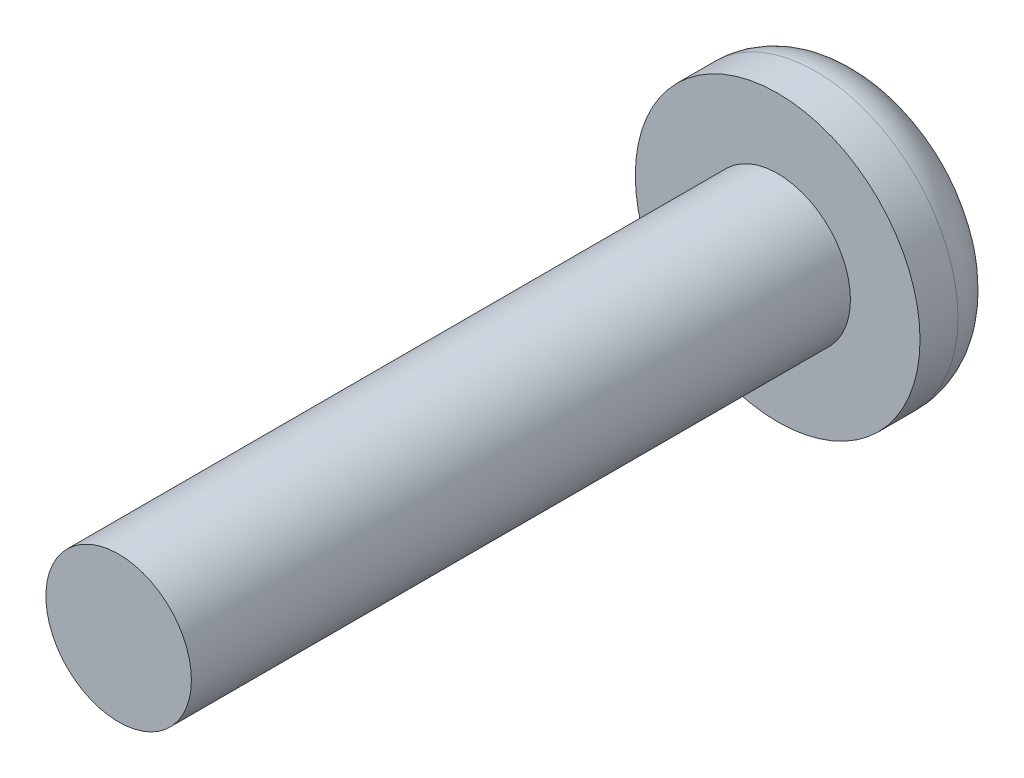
ISO-10303-21;
HEADER;
FILE_DESCRIPTION(('STEP AP214'),'2;1');
FILE_NAME('part.step','',(''),(''),'','','');
FILE_SCHEMA(('AUTOMOTIVE_DESIGN { 1 0 10303 214 1 1 1 1 }'));
ENDSEC;
DATA;
#1=APPLICATION_CONTEXT('core data for automotive mechanical design processes');
#2=APPLICATION_PROTOCOL_DEFINITION('international standard','automotive_design',2000,#1);
#3=PRODUCT_CONTEXT('',#1,'mechanical');
#4=PRODUCT('Part','Part','',(#3));
#5=PRODUCT_RELATED_PRODUCT_CATEGORY('part','',(#4));
#6=PRODUCT_DEFINITION_FORMATION('','',#4);
#7=PRODUCT_DEFINITION_CONTEXT('part definition',#1,'design');
#8=PRODUCT_DEFINITION('design','',#6,#7);
#9=PRODUCT_DEFINITION_SHAPE('','',#8);
#10=(LENGTH_UNIT() NAMED_UNIT(*) SI_UNIT(.MILLI.,.METRE.));
#11=(NAMED_UNIT(*) PLANE_ANGLE_UNIT() SI_UNIT($,.RADIAN.));
#12=(NAMED_UNIT(*) SI_UNIT($,.STERADIAN.) SOLID_ANGLE_UNIT());
#13=UNCERTAINTY_MEASURE_WITH_UNIT(LENGTH_MEASURE(1.E-05),#10,'distance_accuracy_value','');
#14=(GEOMETRIC_REPRESENTATION_CONTEXT(3) GLOBAL_UNCERTAINTY_ASSIGNED_CONTEXT((#13)) GLOBAL_UNIT_ASSIGNED_CONTEXT((#10,
#11,#12)) REPRESENTATION_CONTEXT('',''));
#15=CARTESIAN_POINT('',(0.,0.,0.));
#16=DIRECTION('',(0.,0.,1.));
#17=DIRECTION('',(1.,0.,0.));
#18=AXIS2_PLACEMENT_3D('',#15,#16,#17);
#19=CARTESIAN_POINT('',(0.,0.,-2.0828));
#20=DIRECTION('',(0.,0.,-1.));
#21=DIRECTION('',(-1.,0.,0.));
#22=AXIS2_PLACEMENT_3D('',#19,#20,#21);
#23=PLANE('',#22);
#24=CARTESIAN_POINT('',(0.,0.,-2.0828));
#25=DIRECTION('',(0.,0.,-1.));
#26=DIRECTION('',(-1.,0.,0.));
#27=AXIS2_PLACEMENT_3D('',#24,#25,#26);
#28=CIRCLE('',#27,2.2606);
#29=CARTESIAN_POINT('',(-2.2606,0.,-2.0828));
#30=VERTEX_POINT('',#29);
#31=EDGE_CURVE('E38',#30,#30,#28,.T.);
#32=ORIENTED_EDGE('',*,*,#31,.T.);
#33=EDGE_LOOP('',(#32));
#34=FACE_BOUND('',#33,.T.);
#35=DIRECTION('',(0.,-1.,0.));
#36=VECTOR('',#35,1.);
#37=CARTESIAN_POINT('',(1.7526,0.431799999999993,-2.08279999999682));
#38=LINE('',#37,#36);
#39=CARTESIAN_POINT('',(1.7526,0.431799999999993,-2.08279999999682));
#40=VERTEX_POINT('',#39);
#41=CARTESIAN_POINT('',(1.7526,-0.431800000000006,-2.08279999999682));
#42=VERTEX_POINT('',#41);
#43=EDGE_CURVE('E148',#40,#42,#38,.T.);
#44=ORIENTED_EDGE('',*,*,#43,.F.);
#45=DIRECTION('',(-1.,0.,0.));
#46=VECTOR('',#45,1.);
#47=CARTESIAN_POINT('',(1.7526,0.431799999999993,-2.08279999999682));
#48=LINE('',#47,#46);
#49=CARTESIAN_POINT('',(0.4318,0.431799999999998,-2.08279999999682));
#50=VERTEX_POINT('',#49);
#51=EDGE_CURVE('E147',#40,#50,#48,.T.);
#52=ORIENTED_EDGE('',*,*,#51,.T.);
#53=DIRECTION('',(0.,1.,0.));
#54=VECTOR('',#53,1.);
#55=CARTESIAN_POINT('',(0.4318,0.,-2.08279999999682));
#56=LINE('',#55,#54);
#57=CARTESIAN_POINT('',(0.4318,1.7526,-2.08279999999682));
#58=VERTEX_POINT('',#57);
#59=EDGE_CURVE('E171',#50,#58,#56,.T.);
#60=ORIENTED_EDGE('',*,*,#59,.T.);
#61=DIRECTION('',(1.,0.,0.));
#62=VECTOR('',#61,1.);
#63=CARTESIAN_POINT('',(-0.431799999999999,1.7526,-2.08279999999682));
#64=LINE('',#63,#62);
#65=CARTESIAN_POINT('',(-0.431799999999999,1.7526,-2.08279999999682));
#66=VERTEX_POINT('',#65);
#67=EDGE_CURVE('E173',#66,#58,#64,.T.);
#68=ORIENTED_EDGE('',*,*,#67,.F.);
#69=DIRECTION('',(0.,-1.,0.));
#70=VECTOR('',#69,1.);
#71=CARTESIAN_POINT('',(-0.431799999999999,1.7526,-2.08279999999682));
#72=LINE('',#71,#70);
#73=CARTESIAN_POINT('',(-0.431799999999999,0.431800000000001,-2.08279999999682));
#74=VERTEX_POINT('',#73);
#75=EDGE_CURVE('E146',#66,#74,#72,.T.);
#76=ORIENTED_EDGE('',*,*,#75,.T.);
#77=CARTESIAN_POINT('',(-1.7526,0.431800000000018,-2.08279999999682));
#78=VERTEX_POINT('',#77);
#79=EDGE_CURVE('E125',#74,#78,#48,.T.);
#80=ORIENTED_EDGE('',*,*,#79,.T.);
#81=DIRECTION('',(0.,1.,0.));
#82=VECTOR('',#81,1.);
#83=CARTESIAN_POINT('',(-1.75260000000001,-0.431799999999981,-2.08279999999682));
#84=LINE('',#83,#82);
#85=CARTESIAN_POINT('',(-1.75260000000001,-0.431799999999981,-2.08279999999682));
#86=VERTEX_POINT('',#85);
#87=EDGE_CURVE('E136',#86,#78,#84,.T.);
#88=ORIENTED_EDGE('',*,*,#87,.F.);
#89=DIRECTION('',(1.,0.,0.));
#90=VECTOR('',#89,1.);
#91=CARTESIAN_POINT('',(-1.75260000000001,-0.431799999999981,-2.08279999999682));
#92=LINE('',#91,#90);
#93=CARTESIAN_POINT('',(-0.431800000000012,-0.431799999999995,-2.08279999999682));
#94=VERTEX_POINT('',#93);
#95=EDGE_CURVE('E141',#86,#94,#92,.T.);
#96=ORIENTED_EDGE('',*,*,#95,.T.);
#97=DIRECTION('',(0.,-1.,0.));
#98=VECTOR('',#97,1.);
#99=CARTESIAN_POINT('',(-0.4318,0.,-2.08279999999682));
#100=LINE('',#99,#98);
#101=CARTESIAN_POINT('',(-0.431800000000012,-1.7526,-2.08279999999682));
#102=VERTEX_POINT('',#101);
#103=EDGE_CURVE('E289',#94,#102,#100,.T.);
#104=ORIENTED_EDGE('',*,*,#103,.T.);
#105=DIRECTION('',(-1.,0.,0.));
#106=VECTOR('',#105,1.);
#107=CARTESIAN_POINT('',(0.431799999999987,-1.75260000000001,-2.08279999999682));
#108=LINE('',#107,#106);
#109=CARTESIAN_POINT('',(0.431799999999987,-1.75260000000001,-2.08279999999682));
#110=VERTEX_POINT('',#109);
#111=EDGE_CURVE('E291',#110,#102,#108,.T.);
#112=ORIENTED_EDGE('',*,*,#111,.F.);
#113=DIRECTION('',(0.,1.,0.));
#114=VECTOR('',#113,1.);
#115=CARTESIAN_POINT('',(0.431799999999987,-1.75260000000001,-2.08279999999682));
#116=LINE('',#115,#114);
#117=CARTESIAN_POINT('',(0.431799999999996,-0.431800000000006,-2.08279999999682));
#118=VERTEX_POINT('',#117);
#119=EDGE_CURVE('E294',#110,#118,#116,.T.);
#120=ORIENTED_EDGE('',*,*,#119,.T.);
#121=DIRECTION('',(1.,0.,0.));
#122=VECTOR('',#121,1.);
#123=CARTESIAN_POINT('',(0.,-0.4318,-2.08279999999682));
#124=LINE('',#123,#122);
#125=EDGE_CURVE('E153',#118,#42,#124,.T.);
#126=ORIENTED_EDGE('',*,*,#125,.T.);
#127=EDGE_LOOP('',(#44,#52,#60,#68,#76,#80,#88,#96,#104,#112,#120,#126));
#128=FACE_BOUND('',#127,.T.);
#129=ADVANCED_FACE('F30',(#34,#128),#23,.T.);
#130=CARTESIAN_POINT('',(0.4318,0.,-1.04139999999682));
#131=DIRECTION('',(-1.,0.,0.));
#132=DIRECTION('',(0.,-1.,0.));
#133=AXIS2_PLACEMENT_3D('',#130,#131,#132);
#134=PLANE('',#133);
#135=ORIENTED_EDGE('',*,*,#59,.F.);
#136=DIRECTION('',(0.,0.,1.));
#137=VECTOR('',#136,1.);
#138=CARTESIAN_POINT('',(0.4318,0.431799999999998,-1.04139999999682));
#139=LINE('',#138,#137);
#140=CARTESIAN_POINT('',(0.4318,0.431799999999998,-1.04139999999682));
#141=VERTEX_POINT('',#140);
#142=EDGE_CURVE('E169',#50,#141,#139,.T.);
#143=ORIENTED_EDGE('',*,*,#142,.T.);
#144=DIRECTION('',(0.,1.,0.));
#145=VECTOR('',#144,1.);
#146=CARTESIAN_POINT('',(0.4318,0.,-1.04139999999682));
#147=LINE('',#146,#145);
#148=CARTESIAN_POINT('',(0.4318,1.7526,-1.04139999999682));
#149=VERTEX_POINT('',#148);
#150=EDGE_CURVE('E53',#141,#149,#147,.T.);
#151=ORIENTED_EDGE('',*,*,#150,.T.);
#152=DIRECTION('',(0.,0.,-1.));
#153=VECTOR('',#152,1.);
#154=CARTESIAN_POINT('',(0.4318,1.7526,-1.04139999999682));
#155=LINE('',#154,#153);
#156=EDGE_CURVE('E184',#149,#58,#155,.T.);
#157=ORIENTED_EDGE('',*,*,#156,.T.);
#158=EDGE_LOOP('',(#135,#143,#151,#157));
#159=FACE_BOUND('',#158,.T.);
#160=ADVANCED_FACE('F218',(#159),#134,.T.);
#161=CARTESIAN_POINT('',(-0.431799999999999,1.7526,-1.04139999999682));
#162=DIRECTION('',(1.,0.,0.));
#163=DIRECTION('',(0.,1.,0.));
#164=AXIS2_PLACEMENT_3D('',#161,#162,#163);
#165=PLANE('',#164);
#166=DIRECTION('',(0.,-1.,0.));
#167=VECTOR('',#166,1.);
#168=CARTESIAN_POINT('',(-0.431799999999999,1.7526,-1.04139999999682));
#169=LINE('',#168,#167);
#170=CARTESIAN_POINT('',(-0.431799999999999,1.7526,-1.04139999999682));
#171=VERTEX_POINT('',#170);
#172=CARTESIAN_POINT('',(-0.431799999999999,0.431800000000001,-1.04139999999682));
#173=VERTEX_POINT('',#172);
#174=EDGE_CURVE('E181',#171,#173,#169,.T.);
#175=ORIENTED_EDGE('',*,*,#174,.T.);
#176=DIRECTION('',(0.,0.,-1.));
#177=VECTOR('',#176,1.);
#178=CARTESIAN_POINT('',(-0.4318,0.431800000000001,-1.04139999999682));
#179=LINE('',#178,#177);
#180=EDGE_CURVE('E167',#173,#74,#179,.T.);
#181=ORIENTED_EDGE('',*,*,#180,.T.);
#182=ORIENTED_EDGE('',*,*,#75,.F.);
#183=DIRECTION('',(0.,0.,-1.));
#184=VECTOR('',#183,1.);
#185=CARTESIAN_POINT('',(-0.431799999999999,1.7526,-1.04139999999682));
#186=LINE('',#185,#184);
#187=EDGE_CURVE('E45',#171,#66,#186,.T.);
#188=ORIENTED_EDGE('',*,*,#187,.F.);
#189=EDGE_LOOP('',(#175,#181,#182,#188));
#190=FACE_BOUND('',#189,.T.);
#191=ADVANCED_FACE('F223',(#190),#165,.T.);
#192=CARTESIAN_POINT('',(0.,0.,15.875));
#193=DIRECTION('',(0.,0.,-1.));
#194=DIRECTION('',(-1.,0.,0.));
#195=AXIS2_PLACEMENT_3D('',#192,#193,#194);
#196=CYLINDRICAL_SURFACE('',#195,1.7526);
#197=CARTESIAN_POINT('',(0.,0.,15.875));
#198=DIRECTION('',(0.,0.,1.));
#199=DIRECTION('',(1.,0.,0.));
#200=AXIS2_PLACEMENT_3D('',#197,#198,#199);
#201=CIRCLE('',#200,1.7526);
#202=CARTESIAN_POINT('',(1.7526,0.,15.875));
#203=VERTEX_POINT('',#202);
#204=EDGE_CURVE('E192',#203,#203,#201,.T.);
#205=ORIENTED_EDGE('',*,*,#204,.F.);
#206=EDGE_LOOP('',(#205));
#207=FACE_BOUND('',#206,.T.);
#208=CARTESIAN_POINT('',(0.,0.,0.));
#209=DIRECTION('',(0.,0.,1.));
#210=DIRECTION('',(1.,0.,0.));
#211=AXIS2_PLACEMENT_3D('',#208,#209,#210);
#212=CIRCLE('',#211,1.7526);
#213=CARTESIAN_POINT('',(1.7526,0.,0.));
#214=VERTEX_POINT('',#213);
#215=EDGE_CURVE('E189',#214,#214,#212,.T.);
#216=ORIENTED_EDGE('',*,*,#215,.T.);
#217=EDGE_LOOP('',(#216));
#218=FACE_BOUND('',#217,.T.);
#219=ADVANCED_FACE('F32',(#207,#218),#196,.T.);
#220=CARTESIAN_POINT('',(0.,0.,15.875));
#221=DIRECTION('',(0.,0.,1.));
#222=DIRECTION('',(1.,0.,0.));
#223=AXIS2_PLACEMENT_3D('',#220,#221,#222);
#224=PLANE('',#223);
#225=ORIENTED_EDGE('',*,*,#204,.T.);
#226=EDGE_LOOP('',(#225));
#227=FACE_BOUND('',#226,.T.);
#228=ADVANCED_FACE('F224',(#227),#224,.T.);
#229=CARTESIAN_POINT('',(3.429,0.,0.));
#230=DIRECTION('',(0.,0.,1.));
#231=DIRECTION('',(1.,0.,0.));
#232=AXIS2_PLACEMENT_3D('',#229,#230,#231);
#233=PLANE('',#232);
#234=CARTESIAN_POINT('',(0.,0.,0.));
#235=DIRECTION('',(0.,0.,-1.));
#236=DIRECTION('',(-1.,0.,0.));
#237=AXIS2_PLACEMENT_3D('',#234,#235,#236);
#238=CIRCLE('',#237,3.429);
#239=CARTESIAN_POINT('',(-3.429,0.,0.));
#240=VERTEX_POINT('',#239);
#241=EDGE_CURVE('E186',#240,#240,#238,.T.);
#242=ORIENTED_EDGE('',*,*,#241,.F.);
#243=EDGE_LOOP('',(#242));
#244=FACE_BOUND('',#243,.T.);
#245=ORIENTED_EDGE('',*,*,#215,.F.);
#246=EDGE_LOOP('',(#245));
#247=FACE_BOUND('',#246,.T.);
#248=ADVANCED_FACE('F211',(#244,#247),#233,.T.);
#249=CARTESIAN_POINT('',(0.,0.,-4.84031750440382));
#250=DIRECTION('',(0.,0.,-1.));
#251=DIRECTION('',(-1.,0.,0.));
#252=AXIS2_PLACEMENT_3D('',#249,#250,#251);
#253=CYLINDRICAL_SURFACE('',#252,3.429);
#254=CARTESIAN_POINT('',(0.,0.,-0.9144));
#255=DIRECTION('',(0.,0.,-1.));
#256=DIRECTION('',(-1.,0.,0.));
#257=AXIS2_PLACEMENT_3D('',#254,#255,#256);
#258=CIRCLE('',#257,3.429);
#259=CARTESIAN_POINT('',(-3.429,0.,-0.9144));
#260=VERTEX_POINT('',#259);
#261=EDGE_CURVE('E11',#260,#260,#258,.F.);
#262=ORIENTED_EDGE('',*,*,#261,.T.);
#263=EDGE_LOOP('',(#262));
#264=FACE_BOUND('',#263,.T.);
#265=ORIENTED_EDGE('',*,*,#241,.T.);
#266=EDGE_LOOP('',(#265));
#267=FACE_BOUND('',#266,.T.);
#268=ADVANCED_FACE('F201',(#264,#267),#253,.T.);
#269=CARTESIAN_POINT('',(0.,0.,-0.9144));
#270=DIRECTION('',(0.,0.,-1.));
#271=DIRECTION('',(-1.,0.,0.));
#272=AXIS2_PLACEMENT_3D('',#269,#270,#271);
#273=TOROIDAL_SURFACE('',#272,2.2606,1.1684);
#274=ORIENTED_EDGE('',*,*,#261,.F.);
#275=EDGE_LOOP('',(#274));
#276=FACE_BOUND('',#275,.T.);
#277=ORIENTED_EDGE('',*,*,#31,.F.);
#278=EDGE_LOOP('',(#277));
#279=FACE_BOUND('',#278,.T.);
#280=ADVANCED_FACE('F198',(#276,#279),#273,.T.);
#281=CARTESIAN_POINT('',(-0.431799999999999,1.7526,-1.04139999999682));
#282=DIRECTION('',(0.,1.,0.));
#283=DIRECTION('',(0.,0.,1.));
#284=AXIS2_PLACEMENT_3D('',#281,#282,#283);
#285=PLANE('',#284);
#286=ORIENTED_EDGE('',*,*,#67,.T.);
#287=ORIENTED_EDGE('',*,*,#156,.F.);
#288=DIRECTION('',(1.,0.,0.));
#289=VECTOR('',#288,1.);
#290=CARTESIAN_POINT('',(-0.431799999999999,1.7526,-1.04139999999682));
#291=LINE('',#290,#289);
#292=EDGE_CURVE('E178',#171,#149,#291,.T.);
#293=ORIENTED_EDGE('',*,*,#292,.F.);
#294=ORIENTED_EDGE('',*,*,#187,.T.);
#295=EDGE_LOOP('',(#286,#287,#293,#294));
#296=FACE_BOUND('',#295,.T.);
#297=ADVANCED_FACE('F200',(#296),#285,.F.);
#298=CARTESIAN_POINT('',(0.4318,0.,-1.04139999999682));
#299=DIRECTION('',(0.,0.,1.));
#300=DIRECTION('',(1.,0.,0.));
#301=AXIS2_PLACEMENT_3D('',#298,#299,#300);
#302=PLANE('',#301);
#303=ORIENTED_EDGE('',*,*,#150,.F.);
#304=DIRECTION('',(-1.,0.,0.));
#305=VECTOR('',#304,1.);
#306=CARTESIAN_POINT('',(1.7526,0.431799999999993,-1.04139999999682));
#307=LINE('',#306,#305);
#308=CARTESIAN_POINT('',(1.7526,0.431799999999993,-1.04139999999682));
#309=VERTEX_POINT('',#308);
#310=EDGE_CURVE('E161',#309,#141,#307,.T.);
#311=ORIENTED_EDGE('',*,*,#310,.F.);
#312=DIRECTION('',(0.,-1.,0.));
#313=VECTOR('',#312,1.);
#314=CARTESIAN_POINT('',(1.7526,0.431799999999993,-1.04139999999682));
#315=LINE('',#314,#313);
#316=CARTESIAN_POINT('',(1.7526,-0.431800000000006,-1.04139999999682));
#317=VERTEX_POINT('',#316);
#318=EDGE_CURVE('E158',#309,#317,#315,.T.);
#319=ORIENTED_EDGE('',*,*,#318,.T.);
#320=DIRECTION('',(1.,0.,0.));
#321=VECTOR('',#320,1.);
#322=CARTESIAN_POINT('',(0.,-0.4318,-1.04139999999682));
#323=LINE('',#322,#321);
#324=CARTESIAN_POINT('',(0.431799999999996,-0.431800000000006,-1.04139999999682));
#325=VERTEX_POINT('',#324);
#326=EDGE_CURVE('E151',#325,#317,#323,.T.);
#327=ORIENTED_EDGE('',*,*,#326,.F.);
#328=DIRECTION('',(0.,1.,0.));
#329=VECTOR('',#328,1.);
#330=CARTESIAN_POINT('',(0.431799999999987,-1.75260000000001,-1.04139999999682));
#331=LINE('',#330,#329);
#332=CARTESIAN_POINT('',(0.431799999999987,-1.75260000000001,-1.04139999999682));
#333=VERTEX_POINT('',#332);
#334=EDGE_CURVE('E302',#333,#325,#331,.T.);
#335=ORIENTED_EDGE('',*,*,#334,.F.);
#336=DIRECTION('',(-1.,0.,0.));
#337=VECTOR('',#336,1.);
#338=CARTESIAN_POINT('',(0.431799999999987,-1.75260000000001,-1.04139999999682));
#339=LINE('',#338,#337);
#340=CARTESIAN_POINT('',(-0.431800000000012,-1.7526,-1.04139999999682));
#341=VERTEX_POINT('',#340);
#342=EDGE_CURVE('E299',#333,#341,#339,.T.);
#343=ORIENTED_EDGE('',*,*,#342,.T.);
#344=DIRECTION('',(0.,-1.,0.));
#345=VECTOR('',#344,1.);
#346=CARTESIAN_POINT('',(-0.4318,0.,-1.04139999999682));
#347=LINE('',#346,#345);
#348=CARTESIAN_POINT('',(-0.431800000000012,-0.431799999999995,-1.04139999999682));
#349=VERTEX_POINT('',#348);
#350=EDGE_CURVE('E297',#349,#341,#347,.T.);
#351=ORIENTED_EDGE('',*,*,#350,.F.);
#352=DIRECTION('',(1.,0.,0.));
#353=VECTOR('',#352,1.);
#354=CARTESIAN_POINT('',(-1.75260000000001,-0.431799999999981,-1.04139999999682));
#355=LINE('',#354,#353);
#356=CARTESIAN_POINT('',(-1.75260000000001,-0.431799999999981,-1.04139999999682));
#357=VERTEX_POINT('',#356);
#358=EDGE_CURVE('E283',#357,#349,#355,.T.);
#359=ORIENTED_EDGE('',*,*,#358,.F.);
#360=DIRECTION('',(0.,1.,0.));
#361=VECTOR('',#360,1.);
#362=CARTESIAN_POINT('',(-1.75260000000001,-0.431799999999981,-1.04139999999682));
#363=LINE('',#362,#361);
#364=CARTESIAN_POINT('',(-1.7526,0.431800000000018,-1.04139999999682));
#365=VERTEX_POINT('',#364);
#366=EDGE_CURVE('E281',#357,#365,#363,.T.);
#367=ORIENTED_EDGE('',*,*,#366,.T.);
#368=EDGE_CURVE('E128',#173,#365,#307,.T.);
#369=ORIENTED_EDGE('',*,*,#368,.F.);
#370=ORIENTED_EDGE('',*,*,#174,.F.);
#371=ORIENTED_EDGE('',*,*,#292,.T.);
#372=EDGE_LOOP('',(#303,#311,#319,#327,#335,#343,#351,#359,#367,#369,#370,#371));
#373=FACE_BOUND('',#372,.T.);
#374=ADVANCED_FACE('F208',(#373),#302,.F.);
#375=CARTESIAN_POINT('',(1.7526,0.431799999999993,-1.04139999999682));
#376=DIRECTION('',(0.,-1.,0.));
#377=DIRECTION('',(1.,0.,0.));
#378=AXIS2_PLACEMENT_3D('',#375,#376,#377);
#379=PLANE('',#378);
#380=ORIENTED_EDGE('',*,*,#51,.F.);
#381=DIRECTION('',(0.,0.,-1.));
#382=VECTOR('',#381,1.);
#383=CARTESIAN_POINT('',(1.7526,0.431799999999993,-1.04139999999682));
#384=LINE('',#383,#382);
#385=EDGE_CURVE('E163',#309,#40,#384,.T.);
#386=ORIENTED_EDGE('',*,*,#385,.F.);
#387=ORIENTED_EDGE('',*,*,#310,.T.);
#388=ORIENTED_EDGE('',*,*,#142,.F.);
#389=EDGE_LOOP('',(#380,#386,#387,#388));
#390=FACE_BOUND('',#389,.T.);
#391=ADVANCED_FACE('F246',(#390),#379,.T.);
#392=CARTESIAN_POINT('',(0.,-0.4318,-1.04139999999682));
#393=DIRECTION('',(0.,1.,0.));
#394=DIRECTION('',(-1.,0.,0.));
#395=AXIS2_PLACEMENT_3D('',#392,#393,#394);
#396=PLANE('',#395);
#397=DIRECTION('',(0.,0.,1.));
#398=VECTOR('',#397,1.);
#399=CARTESIAN_POINT('',(0.431799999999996,-0.431800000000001,-1.04139999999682));
#400=LINE('',#399,#398);
#401=EDGE_CURVE('E309',#118,#325,#400,.T.);
#402=ORIENTED_EDGE('',*,*,#401,.T.);
#403=ORIENTED_EDGE('',*,*,#326,.T.);
#404=DIRECTION('',(0.,0.,-1.));
#405=VECTOR('',#404,1.);
#406=CARTESIAN_POINT('',(1.7526,-0.431800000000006,-1.04139999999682));
#407=LINE('',#406,#405);
#408=EDGE_CURVE('E165',#317,#42,#407,.T.);
#409=ORIENTED_EDGE('',*,*,#408,.T.);
#410=ORIENTED_EDGE('',*,*,#125,.F.);
#411=EDGE_LOOP('',(#402,#403,#409,#410));
#412=FACE_BOUND('',#411,.T.);
#413=ADVANCED_FACE('F248',(#412),#396,.T.);
#414=CARTESIAN_POINT('',(1.7526,0.431799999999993,-1.04139999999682));
#415=DIRECTION('',(1.,0.,0.));
#416=DIRECTION('',(0.,1.,0.));
#417=AXIS2_PLACEMENT_3D('',#414,#415,#416);
#418=PLANE('',#417);
#419=ORIENTED_EDGE('',*,*,#43,.T.);
#420=ORIENTED_EDGE('',*,*,#408,.F.);
#421=ORIENTED_EDGE('',*,*,#318,.F.);
#422=ORIENTED_EDGE('',*,*,#385,.T.);
#423=EDGE_LOOP('',(#419,#420,#421,#422));
#424=FACE_BOUND('',#423,.T.);
#425=ADVANCED_FACE('F251',(#424),#418,.F.);
#426=ORIENTED_EDGE('',*,*,#368,.T.);
#427=DIRECTION('',(0.,0.,-1.));
#428=VECTOR('',#427,1.);
#429=CARTESIAN_POINT('',(-1.7526,0.431800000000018,-1.04139999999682));
#430=LINE('',#429,#428);
#431=EDGE_CURVE('E121',#365,#78,#430,.T.);
#432=ORIENTED_EDGE('',*,*,#431,.T.);
#433=ORIENTED_EDGE('',*,*,#79,.F.);
#434=ORIENTED_EDGE('',*,*,#180,.F.);
#435=EDGE_LOOP('',(#426,#432,#433,#434));
#436=FACE_BOUND('',#435,.T.);
#437=ADVANCED_FACE('F123',(#436),#379,.T.);
#438=CARTESIAN_POINT('',(0.431799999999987,-1.75260000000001,-1.04139999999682));
#439=DIRECTION('',(-1.,0.,0.));
#440=DIRECTION('',(0.,-1.,0.));
#441=AXIS2_PLACEMENT_3D('',#438,#439,#440);
#442=PLANE('',#441);
#443=ORIENTED_EDGE('',*,*,#119,.F.);
#444=DIRECTION('',(0.,0.,-1.));
#445=VECTOR('',#444,1.);
#446=CARTESIAN_POINT('',(0.431799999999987,-1.75260000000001,-1.04139999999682));
#447=LINE('',#446,#445);
#448=EDGE_CURVE('E305',#333,#110,#447,.T.);
#449=ORIENTED_EDGE('',*,*,#448,.F.);
#450=ORIENTED_EDGE('',*,*,#334,.T.);
#451=ORIENTED_EDGE('',*,*,#401,.F.);
#452=EDGE_LOOP('',(#443,#449,#450,#451));
#453=FACE_BOUND('',#452,.T.);
#454=ADVANCED_FACE('F258',(#453),#442,.T.);
#455=CARTESIAN_POINT('',(-0.4318,0.,-1.04139999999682));
#456=DIRECTION('',(1.,0.,0.));
#457=DIRECTION('',(0.,1.,0.));
#458=AXIS2_PLACEMENT_3D('',#455,#456,#457);
#459=PLANE('',#458);
#460=DIRECTION('',(0.,0.,1.));
#461=VECTOR('',#460,1.);
#462=CARTESIAN_POINT('',(-0.431800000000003,-0.431799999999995,-1.04139999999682));
#463=LINE('',#462,#461);
#464=EDGE_CURVE('E132',#94,#349,#463,.T.);
#465=ORIENTED_EDGE('',*,*,#464,.T.);
#466=ORIENTED_EDGE('',*,*,#350,.T.);
#467=DIRECTION('',(0.,0.,-1.));
#468=VECTOR('',#467,1.);
#469=CARTESIAN_POINT('',(-0.431800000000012,-1.7526,-1.04139999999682));
#470=LINE('',#469,#468);
#471=EDGE_CURVE('E307',#341,#102,#470,.T.);
#472=ORIENTED_EDGE('',*,*,#471,.T.);
#473=ORIENTED_EDGE('',*,*,#103,.F.);
#474=EDGE_LOOP('',(#465,#466,#472,#473));
#475=FACE_BOUND('',#474,.T.);
#476=ADVANCED_FACE('F259',(#475),#459,.T.);
#477=CARTESIAN_POINT('',(0.431799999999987,-1.75260000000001,-1.04139999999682));
#478=DIRECTION('',(0.,-1.,0.));
#479=DIRECTION('',(1.,0.,0.));
#480=AXIS2_PLACEMENT_3D('',#477,#478,#479);
#481=PLANE('',#480);
#482=ORIENTED_EDGE('',*,*,#111,.T.);
#483=ORIENTED_EDGE('',*,*,#471,.F.);
#484=ORIENTED_EDGE('',*,*,#342,.F.);
#485=ORIENTED_EDGE('',*,*,#448,.T.);
#486=EDGE_LOOP('',(#482,#483,#484,#485));
#487=FACE_BOUND('',#486,.T.);
#488=ADVANCED_FACE('F262',(#487),#481,.F.);
#489=CARTESIAN_POINT('',(-1.75260000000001,-0.431799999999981,-1.04139999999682));
#490=DIRECTION('',(0.,1.,0.));
#491=DIRECTION('',(-1.,0.,0.));
#492=AXIS2_PLACEMENT_3D('',#489,#490,#491);
#493=PLANE('',#492);
#494=ORIENTED_EDGE('',*,*,#95,.F.);
#495=DIRECTION('',(0.,0.,-1.));
#496=VECTOR('',#495,1.);
#497=CARTESIAN_POINT('',(-1.75260000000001,-0.431799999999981,-1.04139999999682));
#498=LINE('',#497,#496);
#499=EDGE_CURVE('E133',#357,#86,#498,.T.);
#500=ORIENTED_EDGE('',*,*,#499,.F.);
#501=ORIENTED_EDGE('',*,*,#358,.T.);
#502=ORIENTED_EDGE('',*,*,#464,.F.);
#503=EDGE_LOOP('',(#494,#500,#501,#502));
#504=FACE_BOUND('',#503,.T.);
#505=ADVANCED_FACE('F266',(#504),#493,.T.);
#506=CARTESIAN_POINT('',(-1.75260000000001,-0.431799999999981,-1.04139999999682));
#507=DIRECTION('',(-1.,0.,0.));
#508=DIRECTION('',(0.,-1.,0.));
#509=AXIS2_PLACEMENT_3D('',#506,#507,#508);
#510=PLANE('',#509);
#511=ORIENTED_EDGE('',*,*,#87,.T.);
#512=ORIENTED_EDGE('',*,*,#431,.F.);
#513=ORIENTED_EDGE('',*,*,#366,.F.);
#514=ORIENTED_EDGE('',*,*,#499,.T.);
#515=EDGE_LOOP('',(#511,#512,#513,#514));
#516=FACE_BOUND('',#515,.T.);
#517=ADVANCED_FACE('F137',(#516),#510,.F.);
#518=CLOSED_SHELL('',(#129,#160,#191,#219,#228,#248,#268,#280,#297,#374,#391,#413,#425,#437,
#454,#476,#488,#505,#517));
#519=MANIFOLD_SOLID_BREP('B2',#518);
#520=ADVANCED_BREP_SHAPE_REPRESENTATION('',(#18,#519),#14);
#521=SHAPE_DEFINITION_REPRESENTATION(#9,#520);
ENDSEC;
END-ISO-10303-21;
